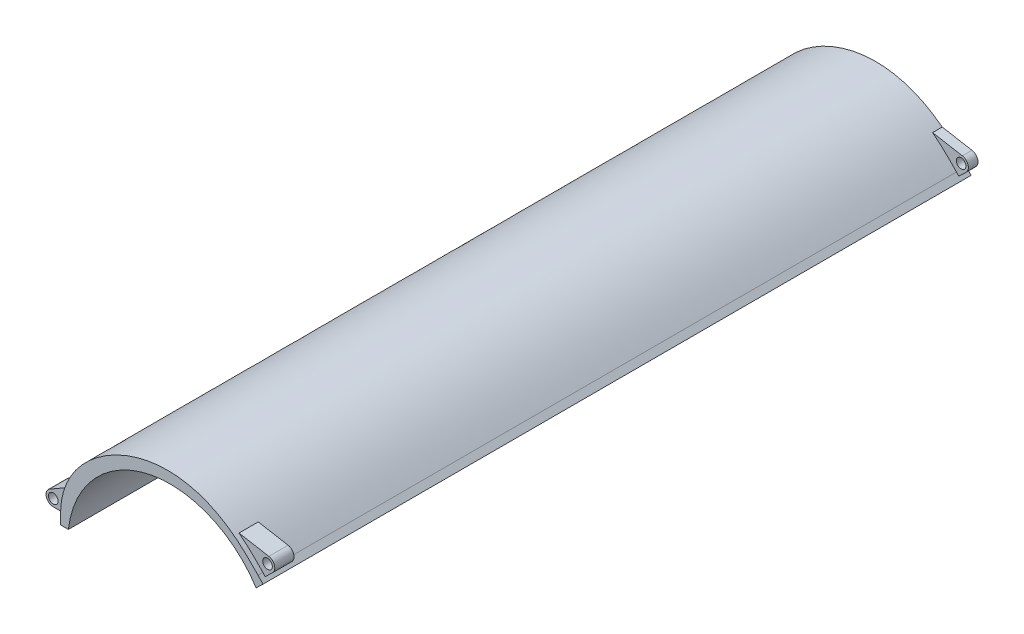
from build123d import *

# Parameters (mm, degrees)
BOSS_EXTRUDE1_DEPTH = 735
BOSS_EXTRUDE2_START = 725
SKETCH3_R           = 10
BOSS_EXTRUDE2_DEPTH = 40
BOSS_EXTRUDE3_START = -715
SKETCH3_4_R         = 10
BOSS_EXTRUDE3_DEPTH = 20


with BuildPart() as part:
    # Sketch1 → Boss-Extrude1 (new, symmetric)
    with BuildSketch(Plane.XY):
        with BuildLine():
            Line((-59.323974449, 128.759639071), (-73.741375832, 114.898234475))
            ThreePointArc((-73.741375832, 114.898234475), (-300.256584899, 207.064141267), (-463.524287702, 25))
            Line((-463.524287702, 25), (-479.524287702, 25))
            Line((-479.524287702, 25), (-479.524287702, 50))
            add(Edge.make_bspline(
                [(-69.720027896, 139.572690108), (-108.18754722, 179.583185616), (-152.416815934, 225.586540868), (-219.133886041, 251.435560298), (-287.408844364, 253.328836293), (-359.356081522, 236.563554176), (-477.15378099, 170.567422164), (-479.524287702, 50)],
                knots=[0, 0, 0, 0, 0, 0, 0, 0, 1, 1, 1, 1, 1, 1, 1, 1], degree=7))
            Line((-69.720027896, 139.572690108), (-59.323974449, 128.759639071))
        make_face()
    extrude(amount=BOSS_EXTRUDE1_DEPTH, both=True)

    # Sketch3 → Boss-Extrude2 (add)
    # profile 1 of 2: a face of its own
    with BuildSketch(Plane.XY.offset(BOSS_EXTRUDE2_START)):
        with BuildLine():
            Line((-505, 40), (-479.524287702, 40))
            Line((-479.524287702, 40), (-479.524287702, 50.000000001))
            add(Edge.make_bspline(
                [(-472.826933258, 90.89563682), (-474.51705784, 85.487785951), (-475.993797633, 79.937195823), (-477.239796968, 74.242499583), (-478.236465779, 68.402452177), (-478.963896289, 62.415949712), (-479.400774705, 56.282050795), (-479.524287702, 50.000000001)],
                knots=[0.947895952, 0.947895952, 0.947895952, 0.947895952, 0.947895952, 0.947895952, 0.947895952, 0.947895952, 1, 1, 1, 1, 1, 1, 1, 1], degree=7))
            Line((-472.826933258, 90.89563682), (-512.5, 67.990381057))
            ThreePointArc((-512.5, 67.990381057), (-519.488887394, 51.117714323), (-505, 40))
        make_face()
        with Locations((-505, 55)):
            Circle(SKETCH3_R, mode=Mode.SUBTRACT)
    # profile 2 of 2: a face of its own
    with BuildSketch(Plane.XY.offset(BOSS_EXTRUDE2_START)):
        with BuildLine():
            Line((-49.603946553, 149.186948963), (-64.860756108, 134.518507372))
            Line((-64.860756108, 134.518507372), (-69.720027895, 139.572690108))
            add(Edge.make_bspline(
                [(-69.720027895, 139.572690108), (-76.074149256, 146.181682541), (-82.585479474, 152.954189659), (-89.329402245, 159.772367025), (-96.35326765, 166.535005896), (-103.683856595, 173.155904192), (-111.333957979, 179.561593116), (-119.307330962, 185.688881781)],
                knots=[0, 0, 0, 0, 0, 0, 0, 0, 0.165181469, 0.165181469, 0.165181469, 0.165181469, 0.165181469, 0.165181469, 0.165181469, 0.165181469], degree=7))
            Line((-119.307330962, 185.688881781), (-57.395277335, 174.772116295))
            ThreePointArc((-57.395277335, 174.772116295), (-45.650601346, 164.369754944), (-49.603946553, 149.186948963))
        make_face()
        with Locations((-60, 160)):
            Circle(SKETCH3_R, mode=Mode.SUBTRACT)
    extrude(amount=-BOSS_EXTRUDE2_DEPTH)

    # Sketch3_4 → Boss-Extrude3 (add)
    # profile 1 of 2: a face of its own
    with BuildSketch(Plane.XY.offset(BOSS_EXTRUDE3_START)):
        with BuildLine():
            Line((-505, 40), (-479.524287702, 40))
            Line((-479.524287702, 40), (-479.524287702, 50.000000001))
            add(Edge.make_bspline(
                [(-472.826933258, 90.89563682), (-474.51705784, 85.487785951), (-475.993797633, 79.937195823), (-477.239796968, 74.242499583), (-478.236465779, 68.402452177), (-478.963896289, 62.415949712), (-479.400774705, 56.282050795), (-479.524287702, 50.000000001)],
                knots=[0.947895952, 0.947895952, 0.947895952, 0.947895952, 0.947895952, 0.947895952, 0.947895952, 0.947895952, 1, 1, 1, 1, 1, 1, 1, 1], degree=7))
            Line((-472.826933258, 90.89563682), (-512.5, 67.990381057))
            ThreePointArc((-512.5, 67.990381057), (-519.488887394, 51.117714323), (-505, 40))
        make_face()
        with Locations((-505, 55)):
            Circle(SKETCH3_4_R, mode=Mode.SUBTRACT)
    # profile 2 of 2: a face of its own
    with BuildSketch(Plane.XY.offset(BOSS_EXTRUDE3_START)):
        with BuildLine():
            Line((-49.603946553, 149.186948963), (-64.860756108, 134.518507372))
            Line((-64.860756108, 134.518507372), (-69.720027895, 139.572690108))
            add(Edge.make_bspline(
                [(-69.720027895, 139.572690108), (-76.074149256, 146.181682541), (-82.585479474, 152.954189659), (-89.329402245, 159.772367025), (-96.35326765, 166.535005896), (-103.683856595, 173.155904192), (-111.333957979, 179.561593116), (-119.307330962, 185.688881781)],
                knots=[0, 0, 0, 0, 0, 0, 0, 0, 0.165181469, 0.165181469, 0.165181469, 0.165181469, 0.165181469, 0.165181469, 0.165181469, 0.165181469], degree=7))
            Line((-119.307330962, 185.688881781), (-57.395277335, 174.772116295))
            ThreePointArc((-57.395277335, 174.772116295), (-45.650601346, 164.369754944), (-49.603946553, 149.186948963))
        make_face()
        with Locations((-60, 160)):
            Circle(SKETCH3_4_R, mode=Mode.SUBTRACT)
    extrude(amount=-BOSS_EXTRUDE3_DEPTH)


solid = part.part
